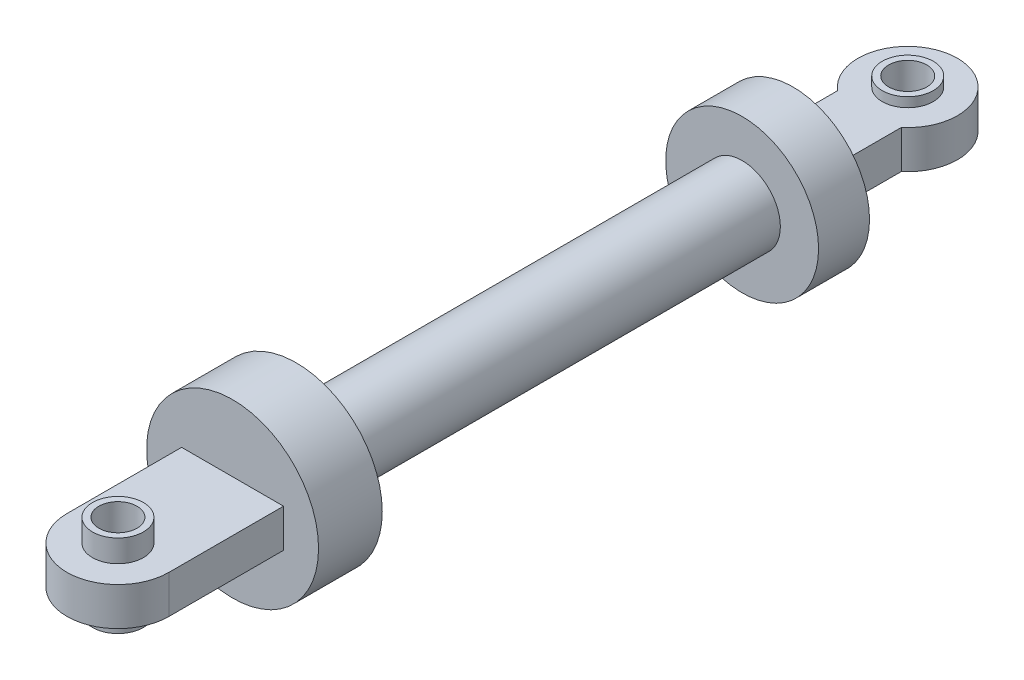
from build123d import *

# Parameters (mm, degrees)
SKETCH_1_R          = 6.75
EXTRUDE_1_DEPTH     = 44
SKETCH_2_R          = 1.5
EXTRUDE_2_DEPTH     = 1.5
SKETCH_6_R          = 1.5
EXTRUDE_3_DEPTH     = 1.5
SKETCH_7_R          = 8
SKETCH_7_R_2        = 3
CUT_EXTRUDE_1_DEPTH = 35
SKETCH_8_R          = 8
SKETCH_8_R_2        = 6
CUT_EXTRUDE_2_DEPTH = 20
SKETCH_9_R          = 2
SKETCH_9_R_2        = 1.5
EXTRUDE_4_DEPTH     = 2.15
EXTRUDE_START       = -5.15
SKETCH_9_2_R        = 2
SKETCH_9_2_R_2      = 1.5
EXTRUDE_5_DEPTH     = 5.15
SKETCH_10_W         = 4
SKETCH_10_H         = 0.4
SKETCH_10_H_2       = 1.4
CUT_EXTRUDE_3_DEPTH = 5


with BuildPart() as part:
    # Sketch 1 → Extrude 1 (new body)
    with BuildSketch(Plane.XY):
        Circle(SKETCH_1_R)
    extrude(amount=EXTRUDE_1_DEPTH)

    # Sketch 2 → Extrude 2 (add, symmetric)
    with BuildSketch(Plane(origin=(0, 0, 0), x_dir=(1, 0, 0), z_dir=(0, 1, 0))):
        with BuildLine():
            Line((-2.5, 0), (2.5, 0))
            Line((2.5, 0), (2.5, 6))
            ThreePointArc((2.5, 6), (0, 12.905124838), (-2.5, 6))
            Line((-2.5, 6), (-2.5, 0))
        make_face()
        with Locations(Location((0, 9, 0), (0, 0, 270))):
            Circle(SKETCH_2_R, mode=Mode.SUBTRACT)
    extrude(amount=EXTRUDE_2_DEPTH, both=True)

    # Sketch 6 → Extrude 3 (add, symmetric)
    with BuildSketch(Plane(origin=(0, 0, 0), x_dir=(1, 0, 0), z_dir=(0, 1, 0))):
        with BuildLine():
            Line((4, -44), (-4, -44))
            Line((-4, -44), (-4, -53))
            ThreePointArc((-4, -53), (0, -57), (4, -53))
            Line((4, -53), (4, -44))
        make_face()
        with Locations(Location((0, -53, 0), (0, 0, 270))):
            Circle(SKETCH_6_R, mode=Mode.SUBTRACT)
    extrude(amount=EXTRUDE_3_DEPTH, both=True)

    # Sketch 7 → Cut-Extrude 1 (cut)
    with BuildSketch(Plane.XY.offset(39)):
        Circle(SKETCH_7_R)
        Circle(SKETCH_7_R_2, mode=Mode.SUBTRACT)
    extrude(amount=-CUT_EXTRUDE_1_DEPTH, mode=Mode.SUBTRACT)

    # Sketch 8 → Cut-Extrude 2 (cut)
    with BuildSketch(Plane.XY.offset(4)):
        Circle(SKETCH_8_R)
        Circle(SKETCH_8_R_2, mode=Mode.SUBTRACT)
    extrude(amount=-CUT_EXTRUDE_2_DEPTH, mode=Mode.SUBTRACT)

    # Sketch 9 → Extrude 4 (add)
    # profile 1 of 2: a face of its own
    with BuildSketch(Plane(origin=(0, 1.5, 0), x_dir=(1, 0, 0), z_dir=(0, 1, 0))):
        with Locations(Location((0, 9, 0), (0, 0, 90))):
            Circle(SKETCH_9_R)
        with Locations(Location((0, 9, 0), (0, 0, 270))):
            Circle(SKETCH_9_R_2, mode=Mode.SUBTRACT)
    # profile 2 of 2: a face of its own
    with BuildSketch(Plane(origin=(0, 1.5, 0), x_dir=(1, 0, 0), z_dir=(0, 1, 0))):
        with Locations(Location((0, -53, 0), (0, 0, 90))):
            Circle(SKETCH_9_R)
        with Locations(Location((0, -53, 0), (0, 0, 270))):
            Circle(SKETCH_9_R_2, mode=Mode.SUBTRACT)
    extrude(amount=EXTRUDE_4_DEPTH)

    # Sketch 9_2 → Extrude 5 (add)
    # profile 1 of 2: a face of its own
    with BuildSketch(Plane(origin=(0, 1.5, 0), x_dir=(1, 0, 0), z_dir=(0, 1, 0)).offset(EXTRUDE_START)):
        with Locations(Location((0, 9, 0), (0, 0, 90))):
            Circle(SKETCH_9_2_R)
        with Locations(Location((0, 9, 0), (0, 0, 270))):
            Circle(SKETCH_9_2_R_2, mode=Mode.SUBTRACT)
    # profile 2 of 2: a face of its own
    with BuildSketch(Plane(origin=(0, 1.5, 0), x_dir=(1, 0, 0), z_dir=(0, 1, 0)).offset(EXTRUDE_START)):
        with Locations(Location((0, -53, 0), (0, 0, 90))):
            Circle(SKETCH_9_2_R)
        with Locations(Location((0, -53, 0), (0, 0, 270))):
            Circle(SKETCH_9_2_R_2, mode=Mode.SUBTRACT)
    extrude(amount=EXTRUDE_5_DEPTH)

    # Sketch 10 → Cut-Extrude 3 (cut, symmetric)
    with BuildSketch(Plane(origin=(0, 0, 0), x_dir=(0, 0, -1), z_dir=(1, 0, 0))):
        with Locations((-53, 3.45)):
            Rectangle(SKETCH_10_W, SKETCH_10_H)
        with Locations((-53, -3.45)):
            Rectangle(SKETCH_10_W, SKETCH_10_H)
        with Locations((9, 2.95)):
            Rectangle(SKETCH_10_W, SKETCH_10_H_2)
        with Locations((9, -2.95)):
            Rectangle(SKETCH_10_W, SKETCH_10_H_2)
    extrude(amount=CUT_EXTRUDE_3_DEPTH, both=True, mode=Mode.SUBTRACT)


solid = part.part
